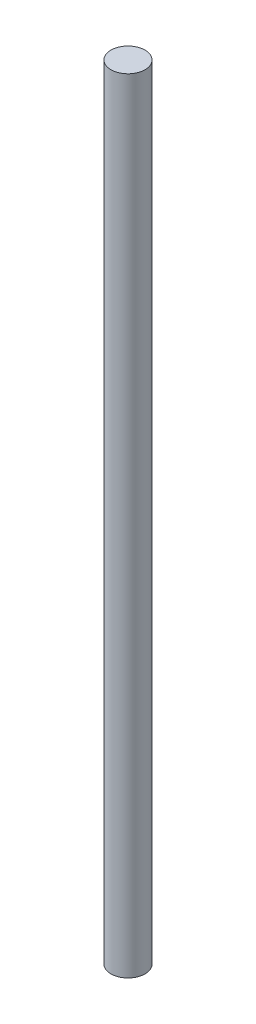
from build123d import *

# Parameters (mm, degrees)
SKETCH1_R           = 3.175
BOSS_EXTRUDE1_DEPTH = 146.05


with BuildPart() as part:
    # Sketch1 → Boss-Extrude1 (new body)
    with BuildSketch(Plane(origin=(0, 0, 0), x_dir=(1, 0, 0), z_dir=(0, 1, 0))):
        with Locations(Location((0, 0, 0), (0, 0, 270))):
            Circle(SKETCH1_R)
    extrude(amount=BOSS_EXTRUDE1_DEPTH)


solid = part.part
